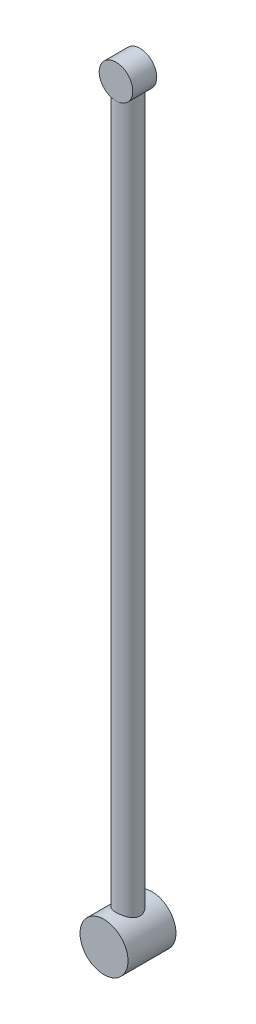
ISO-10303-21;
HEADER;
FILE_DESCRIPTION(('STEP AP214'),'2;1');
FILE_NAME('part.step','',(''),(''),'','','');
FILE_SCHEMA(('AUTOMOTIVE_DESIGN { 1 0 10303 214 1 1 1 1 }'));
ENDSEC;
DATA;
#1=APPLICATION_CONTEXT('core data for automotive mechanical design processes');
#2=APPLICATION_PROTOCOL_DEFINITION('international standard','automotive_design',2000,#1);
#3=PRODUCT_CONTEXT('',#1,'mechanical');
#4=PRODUCT('Part','Part','',(#3));
#5=PRODUCT_RELATED_PRODUCT_CATEGORY('part','',(#4));
#6=PRODUCT_DEFINITION_FORMATION('','',#4);
#7=PRODUCT_DEFINITION_CONTEXT('part definition',#1,'design');
#8=PRODUCT_DEFINITION('design','',#6,#7);
#9=PRODUCT_DEFINITION_SHAPE('','',#8);
#10=(LENGTH_UNIT() NAMED_UNIT(*) SI_UNIT(.MILLI.,.METRE.));
#11=(NAMED_UNIT(*) PLANE_ANGLE_UNIT() SI_UNIT($,.RADIAN.));
#12=(NAMED_UNIT(*) SI_UNIT($,.STERADIAN.) SOLID_ANGLE_UNIT());
#13=UNCERTAINTY_MEASURE_WITH_UNIT(LENGTH_MEASURE(1.E-05),#10,'distance_accuracy_value','');
#14=(GEOMETRIC_REPRESENTATION_CONTEXT(3) GLOBAL_UNCERTAINTY_ASSIGNED_CONTEXT((#13)) GLOBAL_UNIT_ASSIGNED_CONTEXT((#10,
#11,#12)) REPRESENTATION_CONTEXT('',''));
#15=CARTESIAN_POINT('',(0.,0.,0.));
#16=DIRECTION('',(0.,0.,1.));
#17=DIRECTION('',(1.,0.,0.));
#18=AXIS2_PLACEMENT_3D('',#15,#16,#17);
#19=CARTESIAN_POINT('',(0.,0.,-6.35));
#20=DIRECTION('',(0.,0.,1.));
#21=DIRECTION('',(1.,0.,0.));
#22=AXIS2_PLACEMENT_3D('',#19,#20,#21);
#23=CYLINDRICAL_SURFACE('',#22,6.35);
#24=CARTESIAN_POINT('',(0.,0.,6.35));
#25=DIRECTION('',(0.,0.,1.));
#26=DIRECTION('',(1.,0.,0.));
#27=AXIS2_PLACEMENT_3D('',#24,#25,#26);
#28=CIRCLE('',#27,6.35);
#29=CARTESIAN_POINT('',(6.35,0.,6.35));
#30=VERTEX_POINT('',#29);
#31=EDGE_CURVE('E65',#30,#30,#28,.T.);
#32=ORIENTED_EDGE('',*,*,#31,.F.);
#33=EDGE_LOOP('',(#32));
#34=FACE_BOUND('',#33,.T.);
#35=CARTESIAN_POINT('',(0.,0.,-6.35));
#36=DIRECTION('',(0.,0.,1.));
#37=DIRECTION('',(1.,0.,0.));
#38=AXIS2_PLACEMENT_3D('',#35,#36,#37);
#39=CIRCLE('',#38,6.35);
#40=CARTESIAN_POINT('',(6.35,0.,-6.35));
#41=VERTEX_POINT('',#40);
#42=EDGE_CURVE('E71',#41,#41,#39,.T.);
#43=ORIENTED_EDGE('',*,*,#42,.T.);
#44=EDGE_LOOP('',(#43));
#45=FACE_BOUND('',#44,.T.);
#46=CARTESIAN_POINT('',(0.,6.35,-3.175));
#47=CARTESIAN_POINT('',(-0.0834969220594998,6.34999931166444,-3.17499911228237));
#48=CARTESIAN_POINT('',(-0.167002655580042,6.34834758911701,-3.17170012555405));
#49=CARTESIAN_POINT('',(-0.333378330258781,6.34179105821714,-3.15855412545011));
#50=CARTESIAN_POINT('',(-0.416247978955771,6.33688483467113,-3.14870426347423));
#51=CARTESIAN_POINT('',(-0.66318203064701,6.31742426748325,-3.10942793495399));
#52=CARTESIAN_POINT('',(-0.825450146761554,6.29812827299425,-3.0702749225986));
#53=CARTESIAN_POINT('',(-1.13965128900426,6.2489182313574,-2.96800928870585));
#54=CARTESIAN_POINT('',(-1.29162180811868,6.21904547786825,-2.90498978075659));
#55=CARTESIAN_POINT('',(-1.58264035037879,6.15142812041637,-2.7572639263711));
#56=CARTESIAN_POINT('',(-1.72168939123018,6.11368413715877,-2.67255928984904));
#57=CARTESIAN_POINT('',(-1.99234108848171,6.03111096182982,-2.47803037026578));
#58=CARTESIAN_POINT('',(-2.12298433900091,5.98599127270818,-2.36699642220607));
#59=CARTESIAN_POINT('',(-2.36467069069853,5.89470535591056,-2.12560331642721));
#60=CARTESIAN_POINT('',(-2.47569885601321,5.84853836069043,-1.99522957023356));
#61=CARTESIAN_POINT('',(-2.68368848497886,5.75623634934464,-1.70657905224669));
#62=CARTESIAN_POINT('',(-2.77889135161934,5.71038146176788,-1.54692246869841));
#63=CARTESIAN_POINT('',(-2.90019349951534,5.64919759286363,-1.29545201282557));
#64=CARTESIAN_POINT('',(-2.93705266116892,5.63006420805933,-1.20959993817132));
#65=CARTESIAN_POINT('',(-3.00322508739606,5.59504604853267,-1.03441438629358));
#66=CARTESIAN_POINT('',(-3.03254280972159,5.57915935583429,-0.945083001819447));
#67=CARTESIAN_POINT('',(-3.08174263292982,5.55212611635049,-0.768989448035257));
#68=CARTESIAN_POINT('',(-3.10208128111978,5.54075429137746,-0.682389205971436));
#69=CARTESIAN_POINT('',(-3.13545600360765,5.52193654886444,-0.507412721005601));
#70=CARTESIAN_POINT('',(-3.14849595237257,5.51448854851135,-0.419037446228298));
#71=CARTESIAN_POINT('',(-3.1670771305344,5.50383875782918,-0.241293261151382));
#72=CARTESIAN_POINT('',(-3.1726228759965,5.50063441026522,-0.151924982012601));
#73=CARTESIAN_POINT('',(-3.17614778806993,5.49859788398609,0.0269807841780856));
#74=CARTESIAN_POINT('',(-3.17412767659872,5.49976528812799,0.116518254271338));
#75=CARTESIAN_POINT('',(-3.1581193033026,5.50899190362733,0.362747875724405));
#76=CARTESIAN_POINT('',(-3.13621253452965,5.52160857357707,0.518841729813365));
#77=CARTESIAN_POINT('',(-3.07003746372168,5.55866493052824,0.82464664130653));
#78=CARTESIAN_POINT('',(-3.02576203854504,5.58310838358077,0.974355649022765));
#79=CARTESIAN_POINT('',(-2.91531509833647,5.64157885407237,1.26754429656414));
#80=CARTESIAN_POINT('',(-2.84865758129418,5.67581583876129,1.41079760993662));
#81=CARTESIAN_POINT('',(-2.69570761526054,5.75003268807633,1.68476608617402));
#82=CARTESIAN_POINT('',(-2.60940634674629,5.79001512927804,1.81547557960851));
#83=CARTESIAN_POINT('',(-2.40685964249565,5.87734289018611,2.07810427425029));
#84=CARTESIAN_POINT('',(-2.28820488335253,5.92497898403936,2.20807538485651));
#85=CARTESIAN_POINT('',(-2.03058898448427,6.01813700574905,2.44708514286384));
#86=CARTESIAN_POINT('',(-1.89161819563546,6.06365791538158,2.5561137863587));
#87=CARTESIAN_POINT('',(-1.58913989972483,6.1500381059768,2.75490191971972));
#88=CARTESIAN_POINT('',(-1.42479265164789,6.19058274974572,2.84353148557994));
#89=CARTESIAN_POINT('',(-1.08098023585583,6.25976272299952,2.99115808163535));
#90=CARTESIAN_POINT('',(-0.901527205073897,6.28840750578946,3.05017864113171));
#91=CARTESIAN_POINT('',(-0.548533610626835,6.32854759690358,3.13205940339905));
#92=CARTESIAN_POINT('',(-0.375734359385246,6.34126679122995,3.15750967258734));
#93=CARTESIAN_POINT('',(-0.027875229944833,6.35231817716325,3.17965052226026));
#94=CARTESIAN_POINT('',(0.147183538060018,6.35065718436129,3.17635472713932));
#95=CARTESIAN_POINT('',(0.480164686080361,6.33384535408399,3.14259376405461));
#96=CARTESIAN_POINT('',(0.638363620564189,6.31975005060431,3.11425420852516));
#97=CARTESIAN_POINT('',(0.947441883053,6.28085393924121,3.03454412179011));
#98=CARTESIAN_POINT('',(1.09832040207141,6.25605195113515,2.98317105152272));
#99=CARTESIAN_POINT('',(1.39347133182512,6.19709998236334,2.8575048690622));
#100=CARTESIAN_POINT('',(1.53743151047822,6.16270299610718,2.78259841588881));
#101=CARTESIAN_POINT('',(1.8112148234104,6.08787118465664,2.61268357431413));
#102=CARTESIAN_POINT('',(1.94103189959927,6.0474337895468,2.51766662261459));
#103=CARTESIAN_POINT('',(2.19636241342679,5.95973602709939,2.29946064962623));
#104=CARTESIAN_POINT('',(2.3202013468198,5.91219559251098,2.17442139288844));
#105=CARTESIAN_POINT('',(2.54589381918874,5.81858093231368,1.90523764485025));
#106=CARTESIAN_POINT('',(2.6477321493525,5.77250773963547,1.76108004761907));
#107=CARTESIAN_POINT('',(2.83117262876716,5.68487535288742,1.44893139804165));
#108=CARTESIAN_POINT('',(2.91155594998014,5.64364281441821,1.28012423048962));
#109=CARTESIAN_POINT('',(3.04191297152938,5.5744767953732,0.928655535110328));
#110=CARTESIAN_POINT('',(3.0919258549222,5.54652618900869,0.746012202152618));
#111=CARTESIAN_POINT('',(3.15551086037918,5.51057765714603,0.390810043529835));
#112=CARTESIAN_POINT('',(3.17212027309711,5.50092192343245,0.218966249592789));
#113=CARTESIAN_POINT('',(3.17718805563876,5.49800001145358,-0.125244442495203));
#114=CARTESIAN_POINT('',(3.16565862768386,5.50472672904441,-0.297611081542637));
#115=CARTESIAN_POINT('',(3.11761548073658,5.53205211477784,-0.620660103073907));
#116=CARTESIAN_POINT('',(3.08358651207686,5.55126823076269,-0.771843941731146));
#117=CARTESIAN_POINT('',(2.99458164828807,5.59977978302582,-1.06619083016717));
#118=CARTESIAN_POINT('',(2.93959901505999,5.62907846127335,-1.2093512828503));
#119=CARTESIAN_POINT('',(2.8061154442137,5.69685576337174,-1.49423369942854));
#120=CARTESIAN_POINT('',(2.72628260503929,5.73581889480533,-1.63521280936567));
#121=CARTESIAN_POINT('',(2.54682759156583,5.81772207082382,-1.9026974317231));
#122=CARTESIAN_POINT('',(2.44719512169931,5.8606641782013,-2.02919535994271));
#123=CARTESIAN_POINT('',(2.21680287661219,5.95192753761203,-2.28009752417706));
#124=CARTESIAN_POINT('',(2.08373188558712,6.00026839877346,-2.40237975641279));
#125=CARTESIAN_POINT('',(1.79751265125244,6.0921234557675,-2.62339787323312));
#126=CARTESIAN_POINT('',(1.64435365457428,6.13563504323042,-2.72212106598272));
#127=CARTESIAN_POINT('',(1.40178715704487,6.19391073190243,-2.85028026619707));
#128=CARTESIAN_POINT('',(1.31842200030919,6.21223173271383,-2.88980058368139));
#129=CARTESIAN_POINT('',(1.1480770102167,6.24595363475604,-2.9615994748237));
#130=CARTESIAN_POINT('',(1.06109897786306,6.26135597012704,-2.99388160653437));
#131=CARTESIAN_POINT('',(0.884361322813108,6.28875097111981,-3.050759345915));
#132=CARTESIAN_POINT('',(0.794608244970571,6.30075106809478,-3.07537171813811));
#133=CARTESIAN_POINT('',(0.612925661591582,6.32100983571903,-3.11666738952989));
#134=CARTESIAN_POINT('',(0.52099752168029,6.3292707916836,-3.13335553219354));
#135=CARTESIAN_POINT('',(0.357531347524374,6.34032503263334,-3.15561628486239));
#136=CARTESIAN_POINT('',(0.286274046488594,6.34394670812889,-3.16287882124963));
#137=CARTESIAN_POINT('',(0.143346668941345,6.34878452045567,-3.17257112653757));
#138=CARTESIAN_POINT('',(0.071676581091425,6.35000059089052,-3.17500076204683));
#139=CARTESIAN_POINT('',(0.,6.35,-3.175));
#140=B_SPLINE_CURVE_WITH_KNOTS('',3,(#46,#47,#48,#49,#50,#51,#52,#53,#54,#55,#56,#57,#58,#59,
#60,#61,#62,#63,#64,#65,#66,#67,#68,#69,#70,#71,#72,#73,#74,#75,#76,#77,#78,#79,#80,#81,#82,#83,
#84,#85,#86,#87,#88,#89,#90,#91,#92,#93,#94,#95,#96,#97,#98,#99,#100,#101,#102,#103,#104,#105,
#106,#107,#108,#109,#110,#111,#112,#113,#114,#115,#116,#117,#118,#119,#120,#121,#122,#123,#124,
#125,#126,#127,#128,#129,#130,#131,#132,#133,#134,#135,#136,#137,#138,#139),.UNSPECIFIED.,.T.,
.F.,(4,2,2,2,2,2,2,2,2,2,2,2,2,2,2,2,2,2,2,2,2,2,2,2,2,2,2,2,2,2,2,2,2,2,2,2,2,2,2,2,2,2,2,2,2,
2,4),(0.,0.25041561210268,0.500940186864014,1.00234854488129,1.50182051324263,2.00125310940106,
2.53090025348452,3.06094897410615,3.63210298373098,3.91787290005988,4.20347350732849,
4.47213270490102,4.74064915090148,5.00900371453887,5.27733267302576,5.74927594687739,
6.22136960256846,6.70445970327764,7.18776712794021,7.73235646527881,8.27720530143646,
8.84735553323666,9.41705196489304,9.93956405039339,10.4618285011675,10.9436138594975,
11.4254523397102,11.9210677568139,12.4168946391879,12.9614122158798,13.5063050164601,
14.0775857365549,14.6481278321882,15.1639000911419,15.6794487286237,16.1458838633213,
16.6124691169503,17.1104020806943,17.6085946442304,18.1673210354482,18.7263477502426,
19.0082017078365,19.2899168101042,19.5710117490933,19.8519346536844,20.0668939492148,
20.2818591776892),.UNSPECIFIED.);
#141=CARTESIAN_POINT('',(0.,6.35,-3.175));
#142=VERTEX_POINT('',#141);
#143=EDGE_CURVE('E61',#142,#142,#140,.T.);
#144=ORIENTED_EDGE('',*,*,#143,.F.);
#145=EDGE_LOOP('',(#144));
#146=FACE_BOUND('',#145,.T.);
#147=ADVANCED_FACE('F34',(#34,#45,#146),#23,.T.);
#148=CARTESIAN_POINT('',(0.,0.,-6.35));
#149=DIRECTION('',(0.,0.,1.));
#150=DIRECTION('',(1.,0.,0.));
#151=AXIS2_PLACEMENT_3D('',#148,#149,#150);
#152=PLANE('',#151);
#153=ORIENTED_EDGE('',*,*,#42,.F.);
#154=EDGE_LOOP('',(#153));
#155=FACE_BOUND('',#154,.T.);
#156=ADVANCED_FACE('F80',(#155),#152,.F.);
#157=CARTESIAN_POINT('',(0.,0.,6.35));
#158=DIRECTION('',(0.,0.,1.));
#159=DIRECTION('',(1.,0.,0.));
#160=AXIS2_PLACEMENT_3D('',#157,#158,#159);
#161=PLANE('',#160);
#162=ORIENTED_EDGE('',*,*,#31,.T.);
#163=EDGE_LOOP('',(#162));
#164=FACE_BOUND('',#163,.T.);
#165=ADVANCED_FACE('F84',(#164),#161,.T.);
#166=CARTESIAN_POINT('',(0.,196.85,0.));
#167=DIRECTION('',(0.,-1.,0.));
#168=DIRECTION('',(0.,0.,-1.));
#169=AXIS2_PLACEMENT_3D('',#166,#167,#168);
#170=CYLINDRICAL_SURFACE('',#169,3.175);
#171=ORIENTED_EDGE('',*,*,#143,.T.);
#172=EDGE_LOOP('',(#171));
#173=FACE_BOUND('',#172,.T.);
#174=CARTESIAN_POINT('',(0.,192.405,-3.175));
#175=CARTESIAN_POINT('',(0.157135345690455,192.404999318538,-3.17500045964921));
#176=CARTESIAN_POINT('',(0.314264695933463,192.413402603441,-3.16326784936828));
#177=CARTESIAN_POINT('',(0.623439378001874,192.446189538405,-3.11711518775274));
#178=CARTESIAN_POINT('',(0.77548246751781,192.470580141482,-3.08268526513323));
#179=CARTESIAN_POINT('',(1.06951031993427,192.532977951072,-2.99337447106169));
#180=CARTESIAN_POINT('',(1.21154124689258,192.570916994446,-2.93859592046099));
#181=CARTESIAN_POINT('',(1.48365791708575,192.657483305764,-2.8110476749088));
#182=CARTESIAN_POINT('',(1.61374205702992,192.706112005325,-2.73827556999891));
#183=CARTESIAN_POINT('',(1.87146569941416,192.815527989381,-2.56983185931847));
#184=CARTESIAN_POINT('',(1.99784078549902,192.877014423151,-2.47269228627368));
#185=CARTESIAN_POINT('',(2.23366824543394,193.00464615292,-2.26194935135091));
#186=CARTESIAN_POINT('',(2.34309475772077,193.070798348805,-2.14832133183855));
#187=CARTESIAN_POINT('',(2.5029905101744,193.176018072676,-1.95558944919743));
#188=CARTESIAN_POINT('',(2.55931026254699,193.215134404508,-1.88129258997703));
#189=CARTESIAN_POINT('',(2.66544887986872,193.292231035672,-1.72763964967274));
#190=CARTESIAN_POINT('',(2.71526597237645,193.330211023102,-1.64828219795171));
#191=CARTESIAN_POINT('',(2.85439036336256,193.440545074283,-1.40297683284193));
#192=CARTESIAN_POINT('',(2.93368114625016,193.509507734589,-1.22942424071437));
#193=CARTESIAN_POINT('',(3.04064568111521,193.607162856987,-0.923196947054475));
#194=CARTESIAN_POINT('',(3.07671836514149,193.641675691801,-0.795290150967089));
#195=CARTESIAN_POINT('',(3.13277503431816,193.696383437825,-0.533126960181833));
#196=CARTESIAN_POINT('',(3.1527931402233,193.7166087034,-0.398884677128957));
#197=CARTESIAN_POINT('',(3.17543562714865,193.739544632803,-0.126492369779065));
#198=CARTESIAN_POINT('',(3.17794702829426,193.74214152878,0.011677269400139));
#199=CARTESIAN_POINT('',(3.16505586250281,193.729021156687,0.28634015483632));
#200=CARTESIAN_POINT('',(3.14963849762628,193.713288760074,0.422831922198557));
#201=CARTESIAN_POINT('',(3.09905197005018,193.663264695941,0.707068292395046));
#202=CARTESIAN_POINT('',(3.06160879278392,193.626856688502,0.85401939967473));
#203=CARTESIAN_POINT('',(2.96797542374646,193.54043988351,1.13761676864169));
#204=CARTESIAN_POINT('',(2.91174368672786,193.490400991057,1.27423936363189));
#205=CARTESIAN_POINT('',(2.76248418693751,193.365924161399,1.57667078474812));
#206=CARTESIAN_POINT('',(2.66345367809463,193.288730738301,1.7384022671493));
#207=CARTESIAN_POINT('',(2.49546071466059,193.170946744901,1.96523737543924));
#208=CARTESIAN_POINT('',(2.43615958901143,193.131316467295,2.03828078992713));
#209=CARTESIAN_POINT('',(2.31122076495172,193.05240255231,2.17893153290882));
#210=CARTESIAN_POINT('',(2.24558276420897,193.013118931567,2.24653860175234));
#211=CARTESIAN_POINT('',(2.03796614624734,192.896524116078,2.44205554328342));
#212=CARTESIAN_POINT('',(1.88629127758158,192.821208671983,2.56129588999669));
#213=CARTESIAN_POINT('',(1.64166414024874,192.718314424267,2.71937263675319));
#214=CARTESIAN_POINT('',(1.55731179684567,192.685708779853,2.76858315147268));
#215=CARTESIAN_POINT('',(1.38323882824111,192.624698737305,2.85953038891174));
#216=CARTESIAN_POINT('',(1.29352023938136,192.596292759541,2.90126992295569));
#217=CARTESIAN_POINT('',(1.06429426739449,192.531953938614,2.99496111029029));
#218=CARTESIAN_POINT('',(0.921831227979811,192.499099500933,3.04197620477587));
#219=CARTESIAN_POINT('',(0.629369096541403,192.447279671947,3.11564326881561));
#220=CARTESIAN_POINT('',(0.479375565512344,192.428304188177,3.14231003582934));
#221=CARTESIAN_POINT('',(0.175435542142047,192.405844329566,3.17383772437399));
#222=CARTESIAN_POINT('',(0.0214780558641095,192.402409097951,3.17862947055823));
#223=CARTESIAN_POINT('',(-0.28503607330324,192.411498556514,3.16589865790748));
#224=CARTESIAN_POINT('',(-0.437592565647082,192.424024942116,3.14837372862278));
#225=CARTESIAN_POINT('',(-0.729515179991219,192.462916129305,3.09345367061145));
#226=CARTESIAN_POINT('',(-0.869163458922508,192.488593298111,3.05704484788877));
#227=CARTESIAN_POINT('',(-1.13991128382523,192.551399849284,2.96675118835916));
#228=CARTESIAN_POINT('',(-1.27100908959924,192.588531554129,2.91286280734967));
#229=CARTESIAN_POINT('',(-1.5340116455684,192.675586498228,2.78402428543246));
#230=CARTESIAN_POINT('',(-1.66490795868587,192.726365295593,2.7076056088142));
#231=CARTESIAN_POINT('',(-1.91256849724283,192.835221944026,2.53874190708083));
#232=CARTESIAN_POINT('',(-2.02932164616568,192.893305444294,2.44628445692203));
#233=CARTESIAN_POINT('',(-2.2676051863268,193.024084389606,2.2291452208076));
#234=CARTESIAN_POINT('',(-2.38617549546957,193.097521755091,2.10165982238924));
#235=CARTESIAN_POINT('',(-2.60134233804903,193.243350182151,1.82862844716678));
#236=CARTESIAN_POINT('',(-2.69792715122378,193.315740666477,1.68307290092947));
#237=CARTESIAN_POINT('',(-2.85412721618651,193.441128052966,1.39879971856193));
#238=CARTESIAN_POINT('',(-2.91715329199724,193.495391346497,1.26252459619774));
#239=CARTESIAN_POINT('',(-3.0241923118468,193.591552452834,0.978660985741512));
#240=CARTESIAN_POINT('',(-3.06824547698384,193.633476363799,0.831097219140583));
#241=CARTESIAN_POINT('',(-3.12860760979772,193.692264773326,0.555393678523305));
#242=CARTESIAN_POINT('',(-3.14855586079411,193.712342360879,0.428755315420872));
#243=CARTESIAN_POINT('',(-3.17291041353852,193.736964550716,0.172546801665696));
#244=CARTESIAN_POINT('',(-3.17733404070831,193.741526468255,0.0429800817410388));
#245=CARTESIAN_POINT('',(-3.17032863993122,193.734384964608,-0.215254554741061));
#246=CARTESIAN_POINT('',(-3.15889853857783,193.722680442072,-0.34392240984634));
#247=CARTESIAN_POINT('',(-3.12101544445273,193.684881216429,-0.596917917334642));
#248=CARTESIAN_POINT('',(-3.09453921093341,193.658764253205,-0.721238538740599));
#249=CARTESIAN_POINT('',(-3.01669516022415,193.584832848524,-1.00419764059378));
#250=CARTESIAN_POINT('',(-2.95993301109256,193.532665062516,-1.16019174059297));
#251=CARTESIAN_POINT('',(-2.82511343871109,193.417124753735,-1.45815466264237));
#252=CARTESIAN_POINT('',(-2.74702061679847,193.353733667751,-1.60009963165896));
#253=CARTESIAN_POINT('',(-2.56912306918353,193.220908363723,-1.87281477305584));
#254=CARTESIAN_POINT('',(-2.46879081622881,193.151357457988,-2.00318164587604));
#255=CARTESIAN_POINT('',(-2.24872933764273,193.013584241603,-2.24740696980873));
#256=CARTESIAN_POINT('',(-2.12899344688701,192.945362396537,-2.36125972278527));
#257=CARTESIAN_POINT('',(-1.92458168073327,192.842358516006,-2.52706766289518));
#258=CARTESIAN_POINT('',(-1.84588796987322,192.805416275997,-2.58514727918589));
#259=CARTESIAN_POINT('',(-1.68247888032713,192.734759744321,-2.69435339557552));
#260=CARTESIAN_POINT('',(-1.59776640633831,192.701043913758,-2.74548321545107));
#261=CARTESIAN_POINT('',(-1.42278216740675,192.637832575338,-2.84010416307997));
#262=CARTESIAN_POINT('',(-1.33251604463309,192.608332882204,-2.88360287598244));
#263=CARTESIAN_POINT('',(-1.14702292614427,192.554455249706,-2.96228341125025));
#264=CARTESIAN_POINT('',(-1.05179787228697,192.530075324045,-2.99746845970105));
#265=CARTESIAN_POINT('',(-0.802476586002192,192.475281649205,-3.07603025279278));
#266=CARTESIAN_POINT('',(-0.645294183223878,192.449143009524,-3.11294783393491));
#267=CARTESIAN_POINT('',(-0.325402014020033,192.41401089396,-3.16242059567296));
#268=CARTESIAN_POINT('',(-0.162697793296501,192.405000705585,-3.17499952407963));
#269=CARTESIAN_POINT('',(0.,192.405,-3.175));
#270=B_SPLINE_CURVE_WITH_KNOTS('',3,(#174,#175,#176,#177,#178,#179,#180,#181,#182,#183,#184,
#185,#186,#187,#188,#189,#190,#191,#192,#193,#194,#195,#196,#197,#198,#199,#200,#201,#202,#203,
#204,#205,#206,#207,#208,#209,#210,#211,#212,#213,#214,#215,#216,#217,#218,#219,#220,#221,#222,
#223,#224,#225,#226,#227,#228,#229,#230,#231,#232,#233,#234,#235,#236,#237,#238,#239,#240,#241,
#242,#243,#244,#245,#246,#247,#248,#249,#250,#251,#252,#253,#254,#255,#256,#257,#258,#259,#260,
#261,#262,#263,#264,#265,#266,#267,#268,#269),.UNSPECIFIED.,.T.,.F.,(4,2,2,2,2,2,2,2,2,2,2,2,2,
2,2,2,2,2,2,2,2,2,2,2,2,2,2,2,2,2,2,2,2,2,2,2,2,2,2,2,2,2,2,2,2,2,2,4),(0.,0.470761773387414,
0.94172842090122,1.41035823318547,1.8790508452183,2.38975724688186,2.90123540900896,
3.20422499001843,3.50729698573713,4.11187024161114,4.52231828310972,4.93189167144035,
5.34410582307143,5.75666044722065,6.22197984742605,6.6883350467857,7.29922376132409,
7.60522045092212,7.91123174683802,8.52874256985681,8.83721579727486,9.14557270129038,
9.60420610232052,10.0625056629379,10.5222535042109,10.9820501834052,11.4199439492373,
11.8579265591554,12.3356942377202,12.8138337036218,13.3785140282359,13.9434946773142,
14.4208234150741,14.8971352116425,15.2847301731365,15.6718924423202,16.0590809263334,
16.4468691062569,16.9660482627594,17.4860942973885,18.0201291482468,18.5543478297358,
18.8676105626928,19.1807231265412,19.493522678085,19.8062006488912,20.294103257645,
20.7815295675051),.UNSPECIFIED.);
#271=CARTESIAN_POINT('',(0.,192.405,3.175));
#272=VERTEX_POINT('',#271);
#273=CARTESIAN_POINT('',(0.,192.405,-3.175));
#274=VERTEX_POINT('',#273);
#275=EDGE_CURVE('E39',#272,#274,#270,.T.);
#276=ORIENTED_EDGE('',*,*,#275,.T.);
#277=EDGE_CURVE('E11',#274,#272,#270,.T.);
#278=ORIENTED_EDGE('',*,*,#277,.T.);
#279=EDGE_LOOP('',(#276,#278));
#280=FACE_BOUND('',#279,.T.);
#281=ADVANCED_FACE('F36',(#173,#280),#170,.T.);
#282=CARTESIAN_POINT('',(0.,196.85,-3.175));
#283=DIRECTION('',(0.,0.,1.));
#284=DIRECTION('',(1.,0.,0.));
#285=AXIS2_PLACEMENT_3D('',#282,#283,#284);
#286=CYLINDRICAL_SURFACE('',#285,4.445);
#287=ORIENTED_EDGE('',*,*,#277,.F.);
#288=CARTESIAN_POINT('',(0.,196.85,-3.175));
#289=DIRECTION('',(0.,0.,1.));
#290=DIRECTION('',(1.,0.,0.));
#291=AXIS2_PLACEMENT_3D('',#288,#289,#290);
#292=CIRCLE('',#291,4.445);
#293=EDGE_CURVE('E51',#274,#274,#292,.T.);
#294=ORIENTED_EDGE('',*,*,#293,.T.);
#295=ORIENTED_EDGE('',*,*,#275,.F.);
#296=CARTESIAN_POINT('',(0.,196.85,3.175));
#297=DIRECTION('',(0.,0.,1.));
#298=DIRECTION('',(1.,0.,0.));
#299=AXIS2_PLACEMENT_3D('',#296,#297,#298);
#300=CIRCLE('',#299,4.445);
#301=EDGE_CURVE('E59',#272,#272,#300,.T.);
#302=ORIENTED_EDGE('',*,*,#301,.F.);
#303=EDGE_LOOP('',(#287,#294,#295,#302));
#304=FACE_BOUND('',#303,.T.);
#305=ADVANCED_FACE('F58',(#304),#286,.T.);
#306=CARTESIAN_POINT('',(0.,196.85,-3.175));
#307=DIRECTION('',(0.,0.,1.));
#308=DIRECTION('',(1.,0.,0.));
#309=AXIS2_PLACEMENT_3D('',#306,#307,#308);
#310=PLANE('',#309);
#311=ORIENTED_EDGE('',*,*,#293,.F.);
#312=EDGE_LOOP('',(#311));
#313=FACE_BOUND('',#312,.T.);
#314=ADVANCED_FACE('F91',(#313),#310,.F.);
#315=CARTESIAN_POINT('',(0.,196.85,3.175));
#316=DIRECTION('',(0.,0.,1.));
#317=DIRECTION('',(1.,0.,0.));
#318=AXIS2_PLACEMENT_3D('',#315,#316,#317);
#319=PLANE('',#318);
#320=ORIENTED_EDGE('',*,*,#301,.T.);
#321=EDGE_LOOP('',(#320));
#322=FACE_BOUND('',#321,.T.);
#323=ADVANCED_FACE('F63',(#322),#319,.T.);
#324=CLOSED_SHELL('',(#147,#156,#165,#281,#305,#314,#323));
#325=MANIFOLD_SOLID_BREP('B2',#324);
#326=ADVANCED_BREP_SHAPE_REPRESENTATION('',(#18,#325),#14);
#327=SHAPE_DEFINITION_REPRESENTATION(#9,#326);
ENDSEC;
END-ISO-10303-21;
